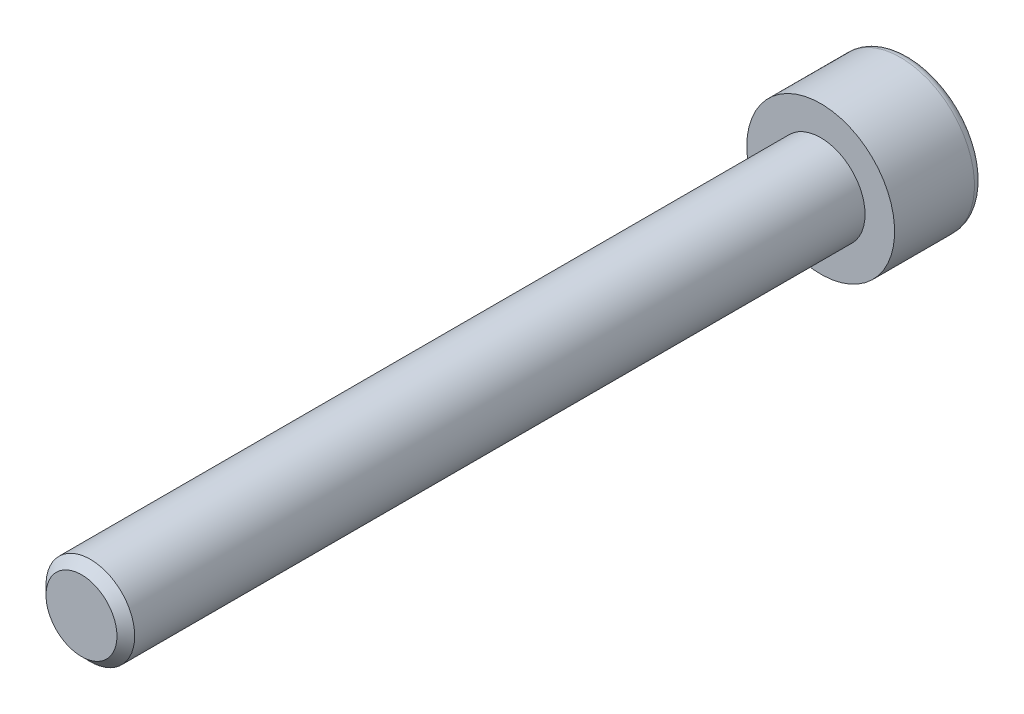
from build123d import *

# Parameters (mm, degrees)
ENLEV_MAT_EXTRU1_DEPTH = 3
ESQUISSE3_W            = 3
ESQUISSE3_H            = 50
CHANFREIN1_SIZE        = 0.6


with BuildPart() as part:
    # Esquisse1 → Base-R_volution (revolve)
    with BuildSketch(Plane(origin=(0, 0, 0), x_dir=(1, 0, 0), z_dir=(0, 1, 0)), mode=Mode.PRIVATE) as base_r_volution_sk:
        with BuildLine():
            Line((0, 0), (5, 0))
            Line((5, 0), (5, 5.4))
            ThreePointArc((5, 5.4), (4.824264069, 5.824264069), (4.4, 6))
            Line((4.4, 6), (0, 6))
            Line((0, 6), (0, 0))
        make_face()
    revolve(base_r_volution_sk.sketch.rotate(Axis((0, 0, 0), (0, 0, -1)), 180), axis=Axis((0, 0, 0), (0, 0, -1)))

    # Esquisse2 → enlev-mat-Extru1 (cut)
    with BuildSketch(Plane.XY.offset(-6)):
        Polygon((2.5, -1.443375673), (2.5, 1.443375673), (0, 2.886751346), (-2.5, 1.443375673), (-2.5, -1.443375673), (0, -2.886751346), align=None)
    extrude(amount=ENLEV_MAT_EXTRU1_DEPTH, mode=Mode.SUBTRACT)

    # Esquisse3 → Boss.-R_vol.1 (revolve)
    with BuildSketch(Plane(origin=(0, 0, 0), x_dir=(1, 0, 0), z_dir=(0, 1, 0))):
        with Locations((1.5, -25)):
            Rectangle(ESQUISSE3_W, ESQUISSE3_H)
    revolve(axis=Axis((0, 0, 0), (0, 0, 1)))

    # Chanfrein1
    chanfrein1_edges = [part.edges().sort_by_distance(p)[0] for p in [
        (-3, 0, 50),
    ]]
    chamfer(chanfrein1_edges, length=CHANFREIN1_SIZE)


solid = part.part
